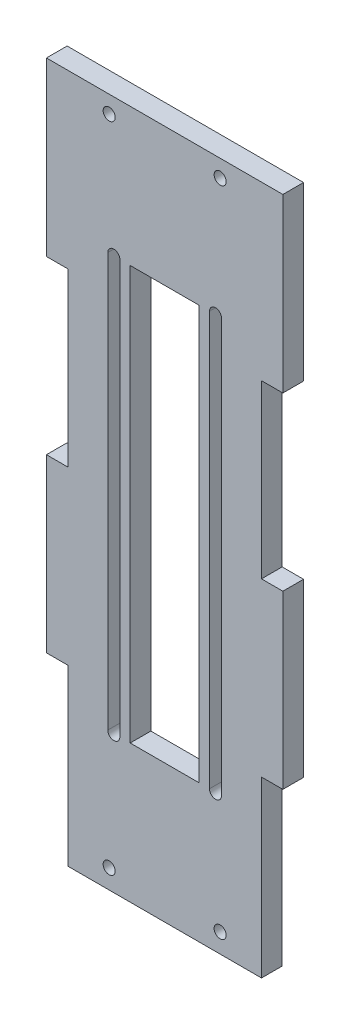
ISO-10303-21;
HEADER;
FILE_DESCRIPTION(('STEP AP214'),'2;1');
FILE_NAME('part.step','',(''),(''),'','','');
FILE_SCHEMA(('AUTOMOTIVE_DESIGN { 1 0 10303 214 1 1 1 1 }'));
ENDSEC;
DATA;
#1=APPLICATION_CONTEXT('core data for automotive mechanical design processes');
#2=APPLICATION_PROTOCOL_DEFINITION('international standard','automotive_design',2000,#1);
#3=PRODUCT_CONTEXT('',#1,'mechanical');
#4=PRODUCT('Part','Part','',(#3));
#5=PRODUCT_RELATED_PRODUCT_CATEGORY('part','',(#4));
#6=PRODUCT_DEFINITION_FORMATION('','',#4);
#7=PRODUCT_DEFINITION_CONTEXT('part definition',#1,'design');
#8=PRODUCT_DEFINITION('design','',#6,#7);
#9=PRODUCT_DEFINITION_SHAPE('','',#8);
#10=(LENGTH_UNIT() NAMED_UNIT(*) SI_UNIT(.MILLI.,.METRE.));
#11=(NAMED_UNIT(*) PLANE_ANGLE_UNIT() SI_UNIT($,.RADIAN.));
#12=(NAMED_UNIT(*) SI_UNIT($,.STERADIAN.) SOLID_ANGLE_UNIT());
#13=UNCERTAINTY_MEASURE_WITH_UNIT(LENGTH_MEASURE(1.E-05),#10,'distance_accuracy_value','');
#14=(GEOMETRIC_REPRESENTATION_CONTEXT(3) GLOBAL_UNCERTAINTY_ASSIGNED_CONTEXT((#13)) GLOBAL_UNIT_ASSIGNED_CONTEXT((#10,
#11,#12)) REPRESENTATION_CONTEXT('',''));
#15=CARTESIAN_POINT('',(0.,0.,0.));
#16=DIRECTION('',(0.,0.,1.));
#17=DIRECTION('',(1.,0.,0.));
#18=AXIS2_PLACEMENT_3D('',#15,#16,#17);
#19=CARTESIAN_POINT('',(0.,0.,6.));
#20=DIRECTION('',(0.,0.,1.));
#21=DIRECTION('',(1.,0.,0.));
#22=AXIS2_PLACEMENT_3D('',#19,#20,#21);
#23=PLANE('',#22);
#24=CARTESIAN_POINT('',(12.,5.60000000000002,6.));
#25=DIRECTION('',(0.,0.,1.));
#26=DIRECTION('',(-1.,0.,0.));
#27=AXIS2_PLACEMENT_3D('',#24,#25,#26);
#28=CIRCLE('',#27,1.75);
#29=CARTESIAN_POINT('',(10.25,5.60000000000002,6.));
#30=VERTEX_POINT('',#29);
#31=EDGE_CURVE('E333',#30,#30,#28,.T.);
#32=ORIENTED_EDGE('',*,*,#31,.F.);
#33=EDGE_LOOP('',(#32));
#34=FACE_BOUND('',#33,.T.);
#35=CARTESIAN_POINT('',(12.,195.,6.));
#36=DIRECTION('',(0.,0.,1.));
#37=DIRECTION('',(1.,0.,0.));
#38=AXIS2_PLACEMENT_3D('',#35,#36,#37);
#39=CIRCLE('',#38,1.75);
#40=CARTESIAN_POINT('',(13.75,195.,6.));
#41=VERTEX_POINT('',#40);
#42=EDGE_CURVE('E349',#41,#41,#39,.T.);
#43=ORIENTED_EDGE('',*,*,#42,.F.);
#44=EDGE_LOOP('',(#43));
#45=FACE_BOUND('',#44,.T.);
#46=DIRECTION('',(0.,-1.,0.));
#47=VECTOR('',#46,1.);
#48=CARTESIAN_POINT('',(0.,0.,6.));
#49=LINE('',#48,#47);
#50=CARTESIAN_POINT('',(0.,50.5,6.));
#51=VERTEX_POINT('',#50);
#52=CARTESIAN_POINT('',(0.,0.,6.));
#53=VERTEX_POINT('',#52);
#54=EDGE_CURVE('E400',#51,#53,#49,.T.);
#55=ORIENTED_EDGE('',*,*,#54,.T.);
#56=DIRECTION('',(1.,0.,0.));
#57=VECTOR('',#56,1.);
#58=CARTESIAN_POINT('',(0.,0.,6.));
#59=LINE('',#58,#57);
#60=CARTESIAN_POINT('',(56.2,0.,6.));
#61=VERTEX_POINT('',#60);
#62=EDGE_CURVE('E404',#53,#61,#59,.T.);
#63=ORIENTED_EDGE('',*,*,#62,.T.);
#64=DIRECTION('',(0.,1.,0.));
#65=VECTOR('',#64,1.);
#66=CARTESIAN_POINT('',(56.2,0.,6.));
#67=LINE('',#66,#65);
#68=CARTESIAN_POINT('',(56.2,50.5,6.));
#69=VERTEX_POINT('',#68);
#70=EDGE_CURVE('E408',#61,#69,#67,.T.);
#71=ORIENTED_EDGE('',*,*,#70,.T.);
#72=DIRECTION('',(1.,0.,0.));
#73=VECTOR('',#72,1.);
#74=CARTESIAN_POINT('',(56.2,50.5,6.));
#75=LINE('',#74,#73);
#76=CARTESIAN_POINT('',(62.4,50.5,6.));
#77=VERTEX_POINT('',#76);
#78=EDGE_CURVE('E411',#69,#77,#75,.T.);
#79=ORIENTED_EDGE('',*,*,#78,.T.);
#80=DIRECTION('',(0.,1.,0.));
#81=VECTOR('',#80,1.);
#82=CARTESIAN_POINT('',(62.4,50.5,6.));
#83=LINE('',#82,#81);
#84=CARTESIAN_POINT('',(62.4,100.3,6.));
#85=VERTEX_POINT('',#84);
#86=EDGE_CURVE('E414',#77,#85,#83,.T.);
#87=ORIENTED_EDGE('',*,*,#86,.T.);
#88=DIRECTION('',(-1.,0.,0.));
#89=VECTOR('',#88,1.);
#90=CARTESIAN_POINT('',(56.2,100.3,6.));
#91=LINE('',#90,#89);
#92=CARTESIAN_POINT('',(56.2,100.3,6.));
#93=VERTEX_POINT('',#92);
#94=EDGE_CURVE('E417',#85,#93,#91,.T.);
#95=ORIENTED_EDGE('',*,*,#94,.T.);
#96=DIRECTION('',(0.,1.,0.));
#97=VECTOR('',#96,1.);
#98=CARTESIAN_POINT('',(56.2,100.3,6.));
#99=LINE('',#98,#97);
#100=CARTESIAN_POINT('',(56.2,150.1,6.));
#101=VERTEX_POINT('',#100);
#102=EDGE_CURVE('E420',#93,#101,#99,.T.);
#103=ORIENTED_EDGE('',*,*,#102,.T.);
#104=DIRECTION('',(1.,0.,0.));
#105=VECTOR('',#104,1.);
#106=CARTESIAN_POINT('',(56.2,150.1,6.));
#107=LINE('',#106,#105);
#108=CARTESIAN_POINT('',(62.4,150.1,6.));
#109=VERTEX_POINT('',#108);
#110=EDGE_CURVE('E423',#101,#109,#107,.T.);
#111=ORIENTED_EDGE('',*,*,#110,.T.);
#112=DIRECTION('',(0.,1.,0.));
#113=VECTOR('',#112,1.);
#114=CARTESIAN_POINT('',(62.4,200.,6.));
#115=LINE('',#114,#113);
#116=CARTESIAN_POINT('',(62.4,200.,6.));
#117=VERTEX_POINT('',#116);
#118=EDGE_CURVE('E426',#109,#117,#115,.T.);
#119=ORIENTED_EDGE('',*,*,#118,.T.);
#120=DIRECTION('',(-1.,0.,0.));
#121=VECTOR('',#120,1.);
#122=CARTESIAN_POINT('',(56.2,200.,6.));
#123=LINE('',#122,#121);
#124=CARTESIAN_POINT('',(-6.2,200.,6.));
#125=VERTEX_POINT('',#124);
#126=EDGE_CURVE('E429',#117,#125,#123,.T.);
#127=ORIENTED_EDGE('',*,*,#126,.T.);
#128=DIRECTION('',(0.,-1.,0.));
#129=VECTOR('',#128,1.);
#130=CARTESIAN_POINT('',(-6.2,150.1,6.));
#131=LINE('',#130,#129);
#132=CARTESIAN_POINT('',(-6.2,150.1,6.));
#133=VERTEX_POINT('',#132);
#134=EDGE_CURVE('E432',#125,#133,#131,.T.);
#135=ORIENTED_EDGE('',*,*,#134,.T.);
#136=DIRECTION('',(1.,0.,0.));
#137=VECTOR('',#136,1.);
#138=CARTESIAN_POINT('',(0.,150.1,6.));
#139=LINE('',#138,#137);
#140=CARTESIAN_POINT('',(0.,150.1,6.));
#141=VERTEX_POINT('',#140);
#142=EDGE_CURVE('E435',#133,#141,#139,.T.);
#143=ORIENTED_EDGE('',*,*,#142,.T.);
#144=DIRECTION('',(0.,-1.,0.));
#145=VECTOR('',#144,1.);
#146=CARTESIAN_POINT('',(0.,100.3,6.));
#147=LINE('',#146,#145);
#148=CARTESIAN_POINT('',(0.,100.3,6.));
#149=VERTEX_POINT('',#148);
#150=EDGE_CURVE('E438',#141,#149,#147,.T.);
#151=ORIENTED_EDGE('',*,*,#150,.T.);
#152=DIRECTION('',(-1.,0.,0.));
#153=VECTOR('',#152,1.);
#154=CARTESIAN_POINT('',(0.,100.3,6.));
#155=LINE('',#154,#153);
#156=CARTESIAN_POINT('',(-6.2,100.3,6.));
#157=VERTEX_POINT('',#156);
#158=EDGE_CURVE('E441',#149,#157,#155,.T.);
#159=ORIENTED_EDGE('',*,*,#158,.T.);
#160=DIRECTION('',(0.,-1.,0.));
#161=VECTOR('',#160,1.);
#162=CARTESIAN_POINT('',(-6.2,50.5,6.));
#163=LINE('',#162,#161);
#164=CARTESIAN_POINT('',(-6.2,50.5,6.));
#165=VERTEX_POINT('',#164);
#166=EDGE_CURVE('E444',#157,#165,#163,.T.);
#167=ORIENTED_EDGE('',*,*,#166,.T.);
#168=DIRECTION('',(1.,0.,0.));
#169=VECTOR('',#168,1.);
#170=CARTESIAN_POINT('',(0.,50.5,6.));
#171=LINE('',#170,#169);
#172=EDGE_CURVE('E447',#165,#51,#171,.T.);
#173=ORIENTED_EDGE('',*,*,#172,.T.);
#174=EDGE_LOOP('',(#55,#63,#71,#79,#87,#95,#103,#111,#119,#127,#135,#143,#151,#159,#167,#173));
#175=FACE_BOUND('',#174,.T.);
#176=DIRECTION('',(0.,-1.,0.));
#177=VECTOR('',#176,1.);
#178=CARTESIAN_POINT('',(11.6,160.,6.));
#179=LINE('',#178,#177);
#180=CARTESIAN_POINT('',(11.6,160.,6.));
#181=VERTEX_POINT('',#180);
#182=CARTESIAN_POINT('',(11.6,40.,6.));
#183=VERTEX_POINT('',#182);
#184=EDGE_CURVE('E360',#181,#183,#179,.T.);
#185=ORIENTED_EDGE('',*,*,#184,.F.);
#186=CARTESIAN_POINT('',(13.35,160.,6.));
#187=DIRECTION('',(0.,0.,1.));
#188=DIRECTION('',(1.,0.,0.));
#189=AXIS2_PLACEMENT_3D('',#186,#187,#188);
#190=CIRCLE('',#189,1.75);
#191=CARTESIAN_POINT('',(15.1,160.,6.));
#192=VERTEX_POINT('',#191);
#193=EDGE_CURVE('E357',#192,#181,#190,.T.);
#194=ORIENTED_EDGE('',*,*,#193,.F.);
#195=DIRECTION('',(0.,1.,0.));
#196=VECTOR('',#195,1.);
#197=CARTESIAN_POINT('',(15.1,160.,6.));
#198=LINE('',#197,#196);
#199=CARTESIAN_POINT('',(15.1,40.,6.));
#200=VERTEX_POINT('',#199);
#201=EDGE_CURVE('E368',#200,#192,#198,.T.);
#202=ORIENTED_EDGE('',*,*,#201,.F.);
#203=CARTESIAN_POINT('',(13.35,40.,6.));
#204=DIRECTION('',(0.,0.,1.));
#205=DIRECTION('',(1.,0.,0.));
#206=AXIS2_PLACEMENT_3D('',#203,#204,#205);
#207=CIRCLE('',#206,1.75);
#208=EDGE_CURVE('E364',#183,#200,#207,.T.);
#209=ORIENTED_EDGE('',*,*,#208,.F.);
#210=EDGE_LOOP('',(#185,#194,#202,#209));
#211=FACE_BOUND('',#210,.T.);
#212=CARTESIAN_POINT('',(44.2,195.,6.));
#213=DIRECTION('',(0.,0.,1.));
#214=DIRECTION('',(-1.,0.,0.));
#215=AXIS2_PLACEMENT_3D('',#212,#213,#214);
#216=CIRCLE('',#215,1.75);
#217=CARTESIAN_POINT('',(42.45,195.,6.));
#218=VERTEX_POINT('',#217);
#219=EDGE_CURVE('E341',#218,#218,#216,.T.);
#220=ORIENTED_EDGE('',*,*,#219,.F.);
#221=EDGE_LOOP('',(#220));
#222=FACE_BOUND('',#221,.T.);
#223=CARTESIAN_POINT('',(44.2,5.60000000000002,6.));
#224=DIRECTION('',(0.,0.,1.));
#225=DIRECTION('',(1.,0.,0.));
#226=AXIS2_PLACEMENT_3D('',#223,#224,#225);
#227=CIRCLE('',#226,1.75);
#228=CARTESIAN_POINT('',(45.95,5.60000000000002,6.));
#229=VERTEX_POINT('',#228);
#230=EDGE_CURVE('E325',#229,#229,#227,.T.);
#231=ORIENTED_EDGE('',*,*,#230,.F.);
#232=EDGE_LOOP('',(#231));
#233=FACE_BOUND('',#232,.T.);
#234=DIRECTION('',(0.,1.,0.));
#235=VECTOR('',#234,1.);
#236=CARTESIAN_POINT('',(44.6,160.,6.));
#237=LINE('',#236,#235);
#238=CARTESIAN_POINT('',(44.6,40.,6.));
#239=VERTEX_POINT('',#238);
#240=CARTESIAN_POINT('',(44.6,160.,6.));
#241=VERTEX_POINT('',#240);
#242=EDGE_CURVE('E285',#239,#241,#237,.T.);
#243=ORIENTED_EDGE('',*,*,#242,.F.);
#244=CARTESIAN_POINT('',(42.85,40.,6.));
#245=DIRECTION('',(0.,0.,1.));
#246=DIRECTION('',(-1.,0.,0.));
#247=AXIS2_PLACEMENT_3D('',#244,#245,#246);
#248=CIRCLE('',#247,1.75);
#249=CARTESIAN_POINT('',(41.1,40.,6.));
#250=VERTEX_POINT('',#249);
#251=EDGE_CURVE('E282',#250,#239,#248,.T.);
#252=ORIENTED_EDGE('',*,*,#251,.F.);
#253=DIRECTION('',(0.,-1.,0.));
#254=VECTOR('',#253,1.);
#255=CARTESIAN_POINT('',(41.1,160.,6.));
#256=LINE('',#255,#254);
#257=CARTESIAN_POINT('',(41.1,160.,6.));
#258=VERTEX_POINT('',#257);
#259=EDGE_CURVE('E293',#258,#250,#256,.T.);
#260=ORIENTED_EDGE('',*,*,#259,.F.);
#261=CARTESIAN_POINT('',(42.85,160.,6.));
#262=DIRECTION('',(0.,0.,1.));
#263=DIRECTION('',(-1.,0.,0.));
#264=AXIS2_PLACEMENT_3D('',#261,#262,#263);
#265=CIRCLE('',#264,1.75);
#266=EDGE_CURVE('E289',#241,#258,#265,.T.);
#267=ORIENTED_EDGE('',*,*,#266,.F.);
#268=EDGE_LOOP('',(#243,#252,#260,#267));
#269=FACE_BOUND('',#268,.T.);
#270=DIRECTION('',(1.,0.,0.));
#271=VECTOR('',#270,1.);
#272=CARTESIAN_POINT('',(18.1,40.,6.));
#273=LINE('',#272,#271);
#274=CARTESIAN_POINT('',(18.1,40.,6.));
#275=VERTEX_POINT('',#274);
#276=CARTESIAN_POINT('',(38.1,40.,6.));
#277=VERTEX_POINT('',#276);
#278=EDGE_CURVE('E242',#275,#277,#273,.T.);
#279=ORIENTED_EDGE('',*,*,#278,.F.);
#280=DIRECTION('',(0.,-1.,0.));
#281=VECTOR('',#280,1.);
#282=CARTESIAN_POINT('',(18.0999999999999,160.,6.));
#283=LINE('',#282,#281);
#284=CARTESIAN_POINT('',(18.0999999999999,160.,6.));
#285=VERTEX_POINT('',#284);
#286=EDGE_CURVE('E233',#285,#275,#283,.T.);
#287=ORIENTED_EDGE('',*,*,#286,.F.);
#288=DIRECTION('',(-1.,0.,0.));
#289=VECTOR('',#288,1.);
#290=CARTESIAN_POINT('',(18.0999999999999,160.,6.));
#291=LINE('',#290,#289);
#292=CARTESIAN_POINT('',(38.0999999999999,160.,6.));
#293=VERTEX_POINT('',#292);
#294=EDGE_CURVE('E260',#293,#285,#291,.T.);
#295=ORIENTED_EDGE('',*,*,#294,.F.);
#296=DIRECTION('',(0.,1.,0.));
#297=VECTOR('',#296,1.);
#298=CARTESIAN_POINT('',(38.0999999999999,160.,6.));
#299=LINE('',#298,#297);
#300=EDGE_CURVE('E255',#277,#293,#299,.T.);
#301=ORIENTED_EDGE('',*,*,#300,.F.);
#302=EDGE_LOOP('',(#279,#287,#295,#301));
#303=FACE_BOUND('',#302,.T.);
#304=ADVANCED_FACE('F47',(#34,#45,#175,#211,#222,#233,#269,#303),#23,.T.);
#305=CARTESIAN_POINT('',(0.,0.,0.));
#306=DIRECTION('',(0.,0.,1.));
#307=DIRECTION('',(1.,0.,0.));
#308=AXIS2_PLACEMENT_3D('',#305,#306,#307);
#309=PLANE('',#308);
#310=CARTESIAN_POINT('',(42.85,40.,0.));
#311=DIRECTION('',(0.,0.,1.));
#312=DIRECTION('',(-1.,0.,0.));
#313=AXIS2_PLACEMENT_3D('',#310,#311,#312);
#314=CIRCLE('',#313,1.75);
#315=CARTESIAN_POINT('',(41.1,40.,0.));
#316=VERTEX_POINT('',#315);
#317=CARTESIAN_POINT('',(44.6,40.,0.));
#318=VERTEX_POINT('',#317);
#319=EDGE_CURVE('E251',#316,#318,#314,.T.);
#320=ORIENTED_EDGE('',*,*,#319,.T.);
#321=DIRECTION('',(0.,1.,0.));
#322=VECTOR('',#321,1.);
#323=CARTESIAN_POINT('',(44.6,160.,0.));
#324=LINE('',#323,#322);
#325=CARTESIAN_POINT('',(44.6,160.,0.));
#326=VERTEX_POINT('',#325);
#327=EDGE_CURVE('E300',#318,#326,#324,.T.);
#328=ORIENTED_EDGE('',*,*,#327,.T.);
#329=CARTESIAN_POINT('',(42.85,160.,0.));
#330=DIRECTION('',(0.,0.,1.));
#331=DIRECTION('',(-1.,0.,0.));
#332=AXIS2_PLACEMENT_3D('',#329,#330,#331);
#333=CIRCLE('',#332,1.75);
#334=CARTESIAN_POINT('',(41.1,160.,0.));
#335=VERTEX_POINT('',#334);
#336=EDGE_CURVE('E304',#326,#335,#333,.T.);
#337=ORIENTED_EDGE('',*,*,#336,.T.);
#338=DIRECTION('',(0.,-1.,0.));
#339=VECTOR('',#338,1.);
#340=CARTESIAN_POINT('',(41.1,160.,0.));
#341=LINE('',#340,#339);
#342=EDGE_CURVE('E286',#335,#316,#341,.T.);
#343=ORIENTED_EDGE('',*,*,#342,.T.);
#344=EDGE_LOOP('',(#320,#328,#337,#343));
#345=FACE_BOUND('',#344,.T.);
#346=DIRECTION('',(0.,-1.,0.));
#347=VECTOR('',#346,1.);
#348=CARTESIAN_POINT('',(0.,0.,0.));
#349=LINE('',#348,#347);
#350=CARTESIAN_POINT('',(0.,50.5,0.));
#351=VERTEX_POINT('',#350);
#352=CARTESIAN_POINT('',(0.,0.,0.));
#353=VERTEX_POINT('',#352);
#354=EDGE_CURVE('E399',#351,#353,#349,.T.);
#355=ORIENTED_EDGE('',*,*,#354,.F.);
#356=DIRECTION('',(1.,0.,0.));
#357=VECTOR('',#356,1.);
#358=CARTESIAN_POINT('',(0.,50.5,0.));
#359=LINE('',#358,#357);
#360=CARTESIAN_POINT('',(-6.2,50.5,0.));
#361=VERTEX_POINT('',#360);
#362=EDGE_CURVE('E405',#361,#351,#359,.T.);
#363=ORIENTED_EDGE('',*,*,#362,.F.);
#364=DIRECTION('',(0.,-1.,0.));
#365=VECTOR('',#364,1.);
#366=CARTESIAN_POINT('',(-6.2,50.5,0.));
#367=LINE('',#366,#365);
#368=CARTESIAN_POINT('',(-6.2,100.3,0.));
#369=VERTEX_POINT('',#368);
#370=EDGE_CURVE('E494',#369,#361,#367,.T.);
#371=ORIENTED_EDGE('',*,*,#370,.F.);
#372=DIRECTION('',(-1.,0.,0.));
#373=VECTOR('',#372,1.);
#374=CARTESIAN_POINT('',(0.,100.3,0.));
#375=LINE('',#374,#373);
#376=CARTESIAN_POINT('',(0.,100.3,0.));
#377=VERTEX_POINT('',#376);
#378=EDGE_CURVE('E491',#377,#369,#375,.T.);
#379=ORIENTED_EDGE('',*,*,#378,.F.);
#380=DIRECTION('',(0.,-1.,0.));
#381=VECTOR('',#380,1.);
#382=CARTESIAN_POINT('',(0.,100.3,0.));
#383=LINE('',#382,#381);
#384=CARTESIAN_POINT('',(0.,150.1,0.));
#385=VERTEX_POINT('',#384);
#386=EDGE_CURVE('E488',#385,#377,#383,.T.);
#387=ORIENTED_EDGE('',*,*,#386,.F.);
#388=DIRECTION('',(1.,0.,0.));
#389=VECTOR('',#388,1.);
#390=CARTESIAN_POINT('',(0.,150.1,0.));
#391=LINE('',#390,#389);
#392=CARTESIAN_POINT('',(-6.2,150.1,0.));
#393=VERTEX_POINT('',#392);
#394=EDGE_CURVE('E485',#393,#385,#391,.T.);
#395=ORIENTED_EDGE('',*,*,#394,.F.);
#396=DIRECTION('',(0.,-1.,0.));
#397=VECTOR('',#396,1.);
#398=CARTESIAN_POINT('',(-6.2,150.1,0.));
#399=LINE('',#398,#397);
#400=CARTESIAN_POINT('',(-6.2,200.,0.));
#401=VERTEX_POINT('',#400);
#402=EDGE_CURVE('E482',#401,#393,#399,.T.);
#403=ORIENTED_EDGE('',*,*,#402,.F.);
#404=DIRECTION('',(-1.,0.,0.));
#405=VECTOR('',#404,1.);
#406=CARTESIAN_POINT('',(0.,200.,0.));
#407=LINE('',#406,#405);
#408=CARTESIAN_POINT('',(62.4,200.,0.));
#409=VERTEX_POINT('',#408);
#410=EDGE_CURVE('E479',#409,#401,#407,.T.);
#411=ORIENTED_EDGE('',*,*,#410,.F.);
#412=DIRECTION('',(0.,1.,0.));
#413=VECTOR('',#412,1.);
#414=CARTESIAN_POINT('',(62.4,200.,0.));
#415=LINE('',#414,#413);
#416=CARTESIAN_POINT('',(62.4,150.1,0.));
#417=VERTEX_POINT('',#416);
#418=EDGE_CURVE('E475',#417,#409,#415,.T.);
#419=ORIENTED_EDGE('',*,*,#418,.F.);
#420=DIRECTION('',(1.,0.,0.));
#421=VECTOR('',#420,1.);
#422=CARTESIAN_POINT('',(56.2,150.1,0.));
#423=LINE('',#422,#421);
#424=CARTESIAN_POINT('',(56.2,150.1,0.));
#425=VERTEX_POINT('',#424);
#426=EDGE_CURVE('E472',#425,#417,#423,.T.);
#427=ORIENTED_EDGE('',*,*,#426,.F.);
#428=DIRECTION('',(0.,1.,0.));
#429=VECTOR('',#428,1.);
#430=CARTESIAN_POINT('',(56.2,100.3,0.));
#431=LINE('',#430,#429);
#432=CARTESIAN_POINT('',(56.2,100.3,0.));
#433=VERTEX_POINT('',#432);
#434=EDGE_CURVE('E469',#433,#425,#431,.T.);
#435=ORIENTED_EDGE('',*,*,#434,.F.);
#436=DIRECTION('',(-1.,0.,0.));
#437=VECTOR('',#436,1.);
#438=CARTESIAN_POINT('',(56.2,100.3,0.));
#439=LINE('',#438,#437);
#440=CARTESIAN_POINT('',(62.4,100.3,0.));
#441=VERTEX_POINT('',#440);
#442=EDGE_CURVE('E466',#441,#433,#439,.T.);
#443=ORIENTED_EDGE('',*,*,#442,.F.);
#444=DIRECTION('',(0.,1.,0.));
#445=VECTOR('',#444,1.);
#446=CARTESIAN_POINT('',(62.4,50.5,0.));
#447=LINE('',#446,#445);
#448=CARTESIAN_POINT('',(62.4,50.5,0.));
#449=VERTEX_POINT('',#448);
#450=EDGE_CURVE('E463',#449,#441,#447,.T.);
#451=ORIENTED_EDGE('',*,*,#450,.F.);
#452=DIRECTION('',(1.,0.,0.));
#453=VECTOR('',#452,1.);
#454=CARTESIAN_POINT('',(56.2,50.5,0.));
#455=LINE('',#454,#453);
#456=CARTESIAN_POINT('',(56.2,50.5,0.));
#457=VERTEX_POINT('',#456);
#458=EDGE_CURVE('E460',#457,#449,#455,.T.);
#459=ORIENTED_EDGE('',*,*,#458,.F.);
#460=DIRECTION('',(0.,1.,0.));
#461=VECTOR('',#460,1.);
#462=CARTESIAN_POINT('',(56.2,0.,0.));
#463=LINE('',#462,#461);
#464=CARTESIAN_POINT('',(56.2,0.,0.));
#465=VERTEX_POINT('',#464);
#466=EDGE_CURVE('E457',#465,#457,#463,.T.);
#467=ORIENTED_EDGE('',*,*,#466,.F.);
#468=DIRECTION('',(1.,0.,0.));
#469=VECTOR('',#468,1.);
#470=CARTESIAN_POINT('',(0.,0.,0.));
#471=LINE('',#470,#469);
#472=EDGE_CURVE('E454',#353,#465,#471,.T.);
#473=ORIENTED_EDGE('',*,*,#472,.F.);
#474=EDGE_LOOP('',(#355,#363,#371,#379,#387,#395,#403,#411,#419,#427,#435,#443,#451,#459,#467,#473));
#475=FACE_BOUND('',#474,.T.);
#476=CARTESIAN_POINT('',(13.35,160.,0.));
#477=DIRECTION('',(0.,0.,1.));
#478=DIRECTION('',(1.,0.,0.));
#479=AXIS2_PLACEMENT_3D('',#476,#477,#478);
#480=CIRCLE('',#479,1.75);
#481=CARTESIAN_POINT('',(15.1,160.,0.));
#482=VERTEX_POINT('',#481);
#483=CARTESIAN_POINT('',(11.6,160.,0.));
#484=VERTEX_POINT('',#483);
#485=EDGE_CURVE('E353',#482,#484,#480,.T.);
#486=ORIENTED_EDGE('',*,*,#485,.T.);
#487=DIRECTION('',(0.,-1.,0.));
#488=VECTOR('',#487,1.);
#489=CARTESIAN_POINT('',(11.6,160.,0.));
#490=LINE('',#489,#488);
#491=CARTESIAN_POINT('',(11.6,40.,0.));
#492=VERTEX_POINT('',#491);
#493=EDGE_CURVE('E375',#484,#492,#490,.T.);
#494=ORIENTED_EDGE('',*,*,#493,.T.);
#495=CARTESIAN_POINT('',(13.35,40.,0.));
#496=DIRECTION('',(0.,0.,1.));
#497=DIRECTION('',(1.,0.,0.));
#498=AXIS2_PLACEMENT_3D('',#495,#496,#497);
#499=CIRCLE('',#498,1.75);
#500=CARTESIAN_POINT('',(15.1,40.,0.));
#501=VERTEX_POINT('',#500);
#502=EDGE_CURVE('E379',#492,#501,#499,.T.);
#503=ORIENTED_EDGE('',*,*,#502,.T.);
#504=DIRECTION('',(0.,1.,0.));
#505=VECTOR('',#504,1.);
#506=CARTESIAN_POINT('',(15.1,160.,0.));
#507=LINE('',#506,#505);
#508=EDGE_CURVE('E361',#501,#482,#507,.T.);
#509=ORIENTED_EDGE('',*,*,#508,.T.);
#510=EDGE_LOOP('',(#486,#494,#503,#509));
#511=FACE_BOUND('',#510,.T.);
#512=CARTESIAN_POINT('',(12.,195.,0.));
#513=DIRECTION('',(0.,0.,1.));
#514=DIRECTION('',(1.,0.,0.));
#515=AXIS2_PLACEMENT_3D('',#512,#513,#514);
#516=CIRCLE('',#515,1.75);
#517=CARTESIAN_POINT('',(13.75,195.,0.));
#518=VERTEX_POINT('',#517);
#519=EDGE_CURVE('E345',#518,#518,#516,.T.);
#520=ORIENTED_EDGE('',*,*,#519,.T.);
#521=EDGE_LOOP('',(#520));
#522=FACE_BOUND('',#521,.T.);
#523=CARTESIAN_POINT('',(44.2,195.,0.));
#524=DIRECTION('',(0.,0.,1.));
#525=DIRECTION('',(-1.,0.,0.));
#526=AXIS2_PLACEMENT_3D('',#523,#524,#525);
#527=CIRCLE('',#526,1.75);
#528=CARTESIAN_POINT('',(42.45,195.,0.));
#529=VERTEX_POINT('',#528);
#530=EDGE_CURVE('E337',#529,#529,#527,.T.);
#531=ORIENTED_EDGE('',*,*,#530,.T.);
#532=EDGE_LOOP('',(#531));
#533=FACE_BOUND('',#532,.T.);
#534=CARTESIAN_POINT('',(12.,5.60000000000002,0.));
#535=DIRECTION('',(0.,0.,1.));
#536=DIRECTION('',(-1.,0.,0.));
#537=AXIS2_PLACEMENT_3D('',#534,#535,#536);
#538=CIRCLE('',#537,1.75);
#539=CARTESIAN_POINT('',(10.25,5.60000000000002,0.));
#540=VERTEX_POINT('',#539);
#541=EDGE_CURVE('E329',#540,#540,#538,.T.);
#542=ORIENTED_EDGE('',*,*,#541,.T.);
#543=EDGE_LOOP('',(#542));
#544=FACE_BOUND('',#543,.T.);
#545=CARTESIAN_POINT('',(44.2,5.60000000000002,0.));
#546=DIRECTION('',(0.,0.,1.));
#547=DIRECTION('',(1.,0.,0.));
#548=AXIS2_PLACEMENT_3D('',#545,#546,#547);
#549=CIRCLE('',#548,1.75);
#550=CARTESIAN_POINT('',(45.95,5.60000000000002,0.));
#551=VERTEX_POINT('',#550);
#552=EDGE_CURVE('E324',#551,#551,#549,.T.);
#553=ORIENTED_EDGE('',*,*,#552,.T.);
#554=EDGE_LOOP('',(#553));
#555=FACE_BOUND('',#554,.T.);
#556=DIRECTION('',(0.,-1.,0.));
#557=VECTOR('',#556,1.);
#558=CARTESIAN_POINT('',(18.0999999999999,160.,0.));
#559=LINE('',#558,#557);
#560=CARTESIAN_POINT('',(18.0999999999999,160.,0.));
#561=VERTEX_POINT('',#560);
#562=CARTESIAN_POINT('',(18.1,40.,0.));
#563=VERTEX_POINT('',#562);
#564=EDGE_CURVE('E71',#561,#563,#559,.T.);
#565=ORIENTED_EDGE('',*,*,#564,.T.);
#566=DIRECTION('',(1.,0.,0.));
#567=VECTOR('',#566,1.);
#568=CARTESIAN_POINT('',(18.1,40.,0.));
#569=LINE('',#568,#567);
#570=CARTESIAN_POINT('',(38.1,40.,0.));
#571=VERTEX_POINT('',#570);
#572=EDGE_CURVE('E249',#563,#571,#569,.T.);
#573=ORIENTED_EDGE('',*,*,#572,.T.);
#574=DIRECTION('',(0.,1.,0.));
#575=VECTOR('',#574,1.);
#576=CARTESIAN_POINT('',(38.0999999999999,160.,0.));
#577=LINE('',#576,#575);
#578=CARTESIAN_POINT('',(38.0999999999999,160.,0.));
#579=VERTEX_POINT('',#578);
#580=EDGE_CURVE('E269',#571,#579,#577,.T.);
#581=ORIENTED_EDGE('',*,*,#580,.T.);
#582=DIRECTION('',(-1.,0.,0.));
#583=VECTOR('',#582,1.);
#584=CARTESIAN_POINT('',(18.0999999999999,160.,0.));
#585=LINE('',#584,#583);
#586=EDGE_CURVE('E243',#579,#561,#585,.T.);
#587=ORIENTED_EDGE('',*,*,#586,.T.);
#588=EDGE_LOOP('',(#565,#573,#581,#587));
#589=FACE_BOUND('',#588,.T.);
#590=ADVANCED_FACE('F566',(#345,#475,#511,#522,#533,#544,#555,#589),#309,.F.);
#591=CARTESIAN_POINT('',(0.,0.,6.));
#592=DIRECTION('',(1.,0.,0.));
#593=DIRECTION('',(0.,0.,-1.));
#594=AXIS2_PLACEMENT_3D('',#591,#592,#593);
#595=PLANE('',#594);
#596=ORIENTED_EDGE('',*,*,#354,.T.);
#597=DIRECTION('',(0.,0.,-1.));
#598=VECTOR('',#597,1.);
#599=CARTESIAN_POINT('',(0.,0.,6.));
#600=LINE('',#599,#598);
#601=EDGE_CURVE('E11',#53,#353,#600,.T.);
#602=ORIENTED_EDGE('',*,*,#601,.F.);
#603=ORIENTED_EDGE('',*,*,#54,.F.);
#604=DIRECTION('',(0.,0.,-1.));
#605=VECTOR('',#604,1.);
#606=CARTESIAN_POINT('',(0.,50.5,6.));
#607=LINE('',#606,#605);
#608=EDGE_CURVE('E450',#51,#351,#607,.T.);
#609=ORIENTED_EDGE('',*,*,#608,.T.);
#610=EDGE_LOOP('',(#596,#602,#603,#609));
#611=FACE_BOUND('',#610,.T.);
#612=ADVANCED_FACE('F49',(#611),#595,.F.);
#613=CARTESIAN_POINT('',(0.,0.,6.));
#614=DIRECTION('',(0.,1.,0.));
#615=DIRECTION('',(0.,0.,1.));
#616=AXIS2_PLACEMENT_3D('',#613,#614,#615);
#617=PLANE('',#616);
#618=ORIENTED_EDGE('',*,*,#472,.T.);
#619=DIRECTION('',(0.,0.,-1.));
#620=VECTOR('',#619,1.);
#621=CARTESIAN_POINT('',(56.2,0.,6.));
#622=LINE('',#621,#620);
#623=EDGE_CURVE('E56',#61,#465,#622,.T.);
#624=ORIENTED_EDGE('',*,*,#623,.F.);
#625=ORIENTED_EDGE('',*,*,#62,.F.);
#626=ORIENTED_EDGE('',*,*,#601,.T.);
#627=EDGE_LOOP('',(#618,#624,#625,#626));
#628=FACE_BOUND('',#627,.T.);
#629=ADVANCED_FACE('F584',(#628),#617,.F.);
#630=CARTESIAN_POINT('',(56.2,0.,6.));
#631=DIRECTION('',(-1.,0.,0.));
#632=DIRECTION('',(0.,0.,1.));
#633=AXIS2_PLACEMENT_3D('',#630,#631,#632);
#634=PLANE('',#633);
#635=ORIENTED_EDGE('',*,*,#466,.T.);
#636=DIRECTION('',(0.,0.,-1.));
#637=VECTOR('',#636,1.);
#638=CARTESIAN_POINT('',(56.2,50.5,6.));
#639=LINE('',#638,#637);
#640=EDGE_CURVE('E550',#69,#457,#639,.T.);
#641=ORIENTED_EDGE('',*,*,#640,.F.);
#642=ORIENTED_EDGE('',*,*,#70,.F.);
#643=ORIENTED_EDGE('',*,*,#623,.T.);
#644=EDGE_LOOP('',(#635,#641,#642,#643));
#645=FACE_BOUND('',#644,.T.);
#646=ADVANCED_FACE('F560',(#645),#634,.F.);
#647=CARTESIAN_POINT('',(56.2,50.5,6.));
#648=DIRECTION('',(0.,1.,0.));
#649=DIRECTION('',(0.,0.,1.));
#650=AXIS2_PLACEMENT_3D('',#647,#648,#649);
#651=PLANE('',#650);
#652=ORIENTED_EDGE('',*,*,#458,.T.);
#653=DIRECTION('',(0.,0.,-1.));
#654=VECTOR('',#653,1.);
#655=CARTESIAN_POINT('',(62.4,50.5,6.));
#656=LINE('',#655,#654);
#657=EDGE_CURVE('E546',#77,#449,#656,.T.);
#658=ORIENTED_EDGE('',*,*,#657,.F.);
#659=ORIENTED_EDGE('',*,*,#78,.F.);
#660=ORIENTED_EDGE('',*,*,#640,.T.);
#661=EDGE_LOOP('',(#652,#658,#659,#660));
#662=FACE_BOUND('',#661,.T.);
#663=ADVANCED_FACE('F572',(#662),#651,.F.);
#664=CARTESIAN_POINT('',(62.4,50.5,6.));
#665=DIRECTION('',(-1.,0.,0.));
#666=DIRECTION('',(0.,0.,1.));
#667=AXIS2_PLACEMENT_3D('',#664,#665,#666);
#668=PLANE('',#667);
#669=ORIENTED_EDGE('',*,*,#450,.T.);
#670=DIRECTION('',(0.,0.,-1.));
#671=VECTOR('',#670,1.);
#672=CARTESIAN_POINT('',(62.4,100.3,6.));
#673=LINE('',#672,#671);
#674=EDGE_CURVE('E542',#85,#441,#673,.T.);
#675=ORIENTED_EDGE('',*,*,#674,.F.);
#676=ORIENTED_EDGE('',*,*,#86,.F.);
#677=ORIENTED_EDGE('',*,*,#657,.T.);
#678=EDGE_LOOP('',(#669,#675,#676,#677));
#679=FACE_BOUND('',#678,.T.);
#680=ADVANCED_FACE('F576',(#679),#668,.F.);
#681=CARTESIAN_POINT('',(56.2,100.3,6.));
#682=DIRECTION('',(0.,-1.,0.));
#683=DIRECTION('',(0.,0.,-1.));
#684=AXIS2_PLACEMENT_3D('',#681,#682,#683);
#685=PLANE('',#684);
#686=ORIENTED_EDGE('',*,*,#442,.T.);
#687=DIRECTION('',(0.,0.,-1.));
#688=VECTOR('',#687,1.);
#689=CARTESIAN_POINT('',(56.2,100.3,6.));
#690=LINE('',#689,#688);
#691=EDGE_CURVE('E538',#93,#433,#690,.T.);
#692=ORIENTED_EDGE('',*,*,#691,.F.);
#693=ORIENTED_EDGE('',*,*,#94,.F.);
#694=ORIENTED_EDGE('',*,*,#674,.T.);
#695=EDGE_LOOP('',(#686,#692,#693,#694));
#696=FACE_BOUND('',#695,.T.);
#697=ADVANCED_FACE('F636',(#696),#685,.F.);
#698=CARTESIAN_POINT('',(56.2,100.3,6.));
#699=DIRECTION('',(-1.,0.,0.));
#700=DIRECTION('',(0.,-1.,0.));
#701=AXIS2_PLACEMENT_3D('',#698,#699,#700);
#702=PLANE('',#701);
#703=ORIENTED_EDGE('',*,*,#434,.T.);
#704=DIRECTION('',(0.,0.,-1.));
#705=VECTOR('',#704,1.);
#706=CARTESIAN_POINT('',(56.2,150.1,6.));
#707=LINE('',#706,#705);
#708=EDGE_CURVE('E534',#101,#425,#707,.T.);
#709=ORIENTED_EDGE('',*,*,#708,.F.);
#710=ORIENTED_EDGE('',*,*,#102,.F.);
#711=ORIENTED_EDGE('',*,*,#691,.T.);
#712=EDGE_LOOP('',(#703,#709,#710,#711));
#713=FACE_BOUND('',#712,.T.);
#714=ADVANCED_FACE('F634',(#713),#702,.F.);
#715=CARTESIAN_POINT('',(56.2,150.1,6.));
#716=DIRECTION('',(0.,1.,0.));
#717=DIRECTION('',(0.,0.,1.));
#718=AXIS2_PLACEMENT_3D('',#715,#716,#717);
#719=PLANE('',#718);
#720=ORIENTED_EDGE('',*,*,#426,.T.);
#721=DIRECTION('',(0.,0.,-1.));
#722=VECTOR('',#721,1.);
#723=CARTESIAN_POINT('',(62.4,150.1,6.));
#724=LINE('',#723,#722);
#725=EDGE_CURVE('E530',#109,#417,#724,.T.);
#726=ORIENTED_EDGE('',*,*,#725,.F.);
#727=ORIENTED_EDGE('',*,*,#110,.F.);
#728=ORIENTED_EDGE('',*,*,#708,.T.);
#729=EDGE_LOOP('',(#720,#726,#727,#728));
#730=FACE_BOUND('',#729,.T.);
#731=ADVANCED_FACE('F631',(#730),#719,.F.);
#732=CARTESIAN_POINT('',(62.4,200.,6.));
#733=DIRECTION('',(-1.,0.,0.));
#734=DIRECTION('',(0.,-1.,0.));
#735=AXIS2_PLACEMENT_3D('',#732,#733,#734);
#736=PLANE('',#735);
#737=ORIENTED_EDGE('',*,*,#418,.T.);
#738=DIRECTION('',(0.,0.,-1.));
#739=VECTOR('',#738,1.);
#740=CARTESIAN_POINT('',(62.4,200.,6.));
#741=LINE('',#740,#739);
#742=EDGE_CURVE('E526',#117,#409,#741,.T.);
#743=ORIENTED_EDGE('',*,*,#742,.F.);
#744=ORIENTED_EDGE('',*,*,#118,.F.);
#745=ORIENTED_EDGE('',*,*,#725,.T.);
#746=EDGE_LOOP('',(#737,#743,#744,#745));
#747=FACE_BOUND('',#746,.T.);
#748=ADVANCED_FACE('F622',(#747),#736,.F.);
#749=CARTESIAN_POINT('',(0.,200.,6.));
#750=DIRECTION('',(0.,-1.,0.));
#751=DIRECTION('',(0.,0.,-1.));
#752=AXIS2_PLACEMENT_3D('',#749,#750,#751);
#753=PLANE('',#752);
#754=ORIENTED_EDGE('',*,*,#410,.T.);
#755=DIRECTION('',(0.,0.,-1.));
#756=VECTOR('',#755,1.);
#757=CARTESIAN_POINT('',(-6.2,200.,6.));
#758=LINE('',#757,#756);
#759=EDGE_CURVE('E522',#125,#401,#758,.T.);
#760=ORIENTED_EDGE('',*,*,#759,.F.);
#761=ORIENTED_EDGE('',*,*,#126,.F.);
#762=ORIENTED_EDGE('',*,*,#742,.T.);
#763=EDGE_LOOP('',(#754,#760,#761,#762));
#764=FACE_BOUND('',#763,.T.);
#765=ADVANCED_FACE('F626',(#764),#753,.F.);
#766=CARTESIAN_POINT('',(-6.2,150.1,6.));
#767=DIRECTION('',(1.,0.,0.));
#768=DIRECTION('',(0.,1.,0.));
#769=AXIS2_PLACEMENT_3D('',#766,#767,#768);
#770=PLANE('',#769);
#771=ORIENTED_EDGE('',*,*,#402,.T.);
#772=DIRECTION('',(0.,0.,-1.));
#773=VECTOR('',#772,1.);
#774=CARTESIAN_POINT('',(-6.2,150.1,6.));
#775=LINE('',#774,#773);
#776=EDGE_CURVE('E518',#133,#393,#775,.T.);
#777=ORIENTED_EDGE('',*,*,#776,.F.);
#778=ORIENTED_EDGE('',*,*,#134,.F.);
#779=ORIENTED_EDGE('',*,*,#759,.T.);
#780=EDGE_LOOP('',(#771,#777,#778,#779));
#781=FACE_BOUND('',#780,.T.);
#782=ADVANCED_FACE('F615',(#781),#770,.F.);
#783=CARTESIAN_POINT('',(0.,150.1,6.));
#784=DIRECTION('',(0.,1.,0.));
#785=DIRECTION('',(0.,0.,1.));
#786=AXIS2_PLACEMENT_3D('',#783,#784,#785);
#787=PLANE('',#786);
#788=ORIENTED_EDGE('',*,*,#394,.T.);
#789=DIRECTION('',(0.,0.,-1.));
#790=VECTOR('',#789,1.);
#791=CARTESIAN_POINT('',(0.,150.1,6.));
#792=LINE('',#791,#790);
#793=EDGE_CURVE('E514',#141,#385,#792,.T.);
#794=ORIENTED_EDGE('',*,*,#793,.F.);
#795=ORIENTED_EDGE('',*,*,#142,.F.);
#796=ORIENTED_EDGE('',*,*,#776,.T.);
#797=EDGE_LOOP('',(#788,#794,#795,#796));
#798=FACE_BOUND('',#797,.T.);
#799=ADVANCED_FACE('F611',(#798),#787,.F.);
#800=CARTESIAN_POINT('',(0.,100.3,6.));
#801=DIRECTION('',(1.,0.,0.));
#802=DIRECTION('',(0.,1.,0.));
#803=AXIS2_PLACEMENT_3D('',#800,#801,#802);
#804=PLANE('',#803);
#805=ORIENTED_EDGE('',*,*,#386,.T.);
#806=DIRECTION('',(0.,0.,-1.));
#807=VECTOR('',#806,1.);
#808=CARTESIAN_POINT('',(0.,100.3,6.));
#809=LINE('',#808,#807);
#810=EDGE_CURVE('E510',#149,#377,#809,.T.);
#811=ORIENTED_EDGE('',*,*,#810,.F.);
#812=ORIENTED_EDGE('',*,*,#150,.F.);
#813=ORIENTED_EDGE('',*,*,#793,.T.);
#814=EDGE_LOOP('',(#805,#811,#812,#813));
#815=FACE_BOUND('',#814,.T.);
#816=ADVANCED_FACE('F606',(#815),#804,.F.);
#817=CARTESIAN_POINT('',(0.,100.3,6.));
#818=DIRECTION('',(0.,-1.,0.));
#819=DIRECTION('',(0.,0.,-1.));
#820=AXIS2_PLACEMENT_3D('',#817,#818,#819);
#821=PLANE('',#820);
#822=ORIENTED_EDGE('',*,*,#378,.T.);
#823=DIRECTION('',(0.,0.,-1.));
#824=VECTOR('',#823,1.);
#825=CARTESIAN_POINT('',(-6.2,100.3,6.));
#826=LINE('',#825,#824);
#827=EDGE_CURVE('E506',#157,#369,#826,.T.);
#828=ORIENTED_EDGE('',*,*,#827,.F.);
#829=ORIENTED_EDGE('',*,*,#158,.F.);
#830=ORIENTED_EDGE('',*,*,#810,.T.);
#831=EDGE_LOOP('',(#822,#828,#829,#830));
#832=FACE_BOUND('',#831,.T.);
#833=ADVANCED_FACE('F600',(#832),#821,.F.);
#834=CARTESIAN_POINT('',(-6.2,50.5,6.));
#835=DIRECTION('',(1.,0.,0.));
#836=DIRECTION('',(0.,0.,-1.));
#837=AXIS2_PLACEMENT_3D('',#834,#835,#836);
#838=PLANE('',#837);
#839=ORIENTED_EDGE('',*,*,#370,.T.);
#840=DIRECTION('',(0.,0.,-1.));
#841=VECTOR('',#840,1.);
#842=CARTESIAN_POINT('',(-6.2,50.5,6.));
#843=LINE('',#842,#841);
#844=EDGE_CURVE('E502',#165,#361,#843,.T.);
#845=ORIENTED_EDGE('',*,*,#844,.F.);
#846=ORIENTED_EDGE('',*,*,#166,.F.);
#847=ORIENTED_EDGE('',*,*,#827,.T.);
#848=EDGE_LOOP('',(#839,#845,#846,#847));
#849=FACE_BOUND('',#848,.T.);
#850=ADVANCED_FACE('F596',(#849),#838,.F.);
#851=CARTESIAN_POINT('',(0.,50.5,6.));
#852=DIRECTION('',(0.,1.,0.));
#853=DIRECTION('',(0.,0.,1.));
#854=AXIS2_PLACEMENT_3D('',#851,#852,#853);
#855=PLANE('',#854);
#856=ORIENTED_EDGE('',*,*,#362,.T.);
#857=ORIENTED_EDGE('',*,*,#608,.F.);
#858=ORIENTED_EDGE('',*,*,#172,.F.);
#859=ORIENTED_EDGE('',*,*,#844,.T.);
#860=EDGE_LOOP('',(#856,#857,#858,#859));
#861=FACE_BOUND('',#860,.T.);
#862=ADVANCED_FACE('F591',(#861),#855,.F.);
#863=CARTESIAN_POINT('',(13.35,160.,6.));
#864=DIRECTION('',(0.,0.,-1.));
#865=DIRECTION('',(-1.,0.,0.));
#866=AXIS2_PLACEMENT_3D('',#863,#864,#865);
#867=CYLINDRICAL_SURFACE('',#866,1.75);
#868=ORIENTED_EDGE('',*,*,#485,.F.);
#869=DIRECTION('',(0.,0.,-1.));
#870=VECTOR('',#869,1.);
#871=CARTESIAN_POINT('',(15.1,160.,6.));
#872=LINE('',#871,#870);
#873=EDGE_CURVE('E371',#192,#482,#872,.T.);
#874=ORIENTED_EDGE('',*,*,#873,.F.);
#875=ORIENTED_EDGE('',*,*,#193,.T.);
#876=DIRECTION('',(0.,0.,-1.));
#877=VECTOR('',#876,1.);
#878=CARTESIAN_POINT('',(11.6,160.,6.));
#879=LINE('',#878,#877);
#880=EDGE_CURVE('E395',#181,#484,#879,.T.);
#881=ORIENTED_EDGE('',*,*,#880,.T.);
#882=EDGE_LOOP('',(#868,#874,#875,#881));
#883=FACE_BOUND('',#882,.T.);
#884=ADVANCED_FACE('F656',(#883),#867,.F.);
#885=CARTESIAN_POINT('',(11.6,160.,6.));
#886=DIRECTION('',(1.,0.,0.));
#887=DIRECTION('',(0.,1.,0.));
#888=AXIS2_PLACEMENT_3D('',#885,#886,#887);
#889=PLANE('',#888);
#890=ORIENTED_EDGE('',*,*,#493,.F.);
#891=ORIENTED_EDGE('',*,*,#880,.F.);
#892=ORIENTED_EDGE('',*,*,#184,.T.);
#893=DIRECTION('',(0.,0.,-1.));
#894=VECTOR('',#893,1.);
#895=CARTESIAN_POINT('',(11.6,40.,6.));
#896=LINE('',#895,#894);
#897=EDGE_CURVE('E392',#183,#492,#896,.T.);
#898=ORIENTED_EDGE('',*,*,#897,.T.);
#899=EDGE_LOOP('',(#890,#891,#892,#898));
#900=FACE_BOUND('',#899,.T.);
#901=ADVANCED_FACE('F728',(#900),#889,.T.);
#902=CARTESIAN_POINT('',(13.35,40.,6.));
#903=DIRECTION('',(0.,0.,-1.));
#904=DIRECTION('',(-1.,0.,0.));
#905=AXIS2_PLACEMENT_3D('',#902,#903,#904);
#906=CYLINDRICAL_SURFACE('',#905,1.75);
#907=ORIENTED_EDGE('',*,*,#502,.F.);
#908=ORIENTED_EDGE('',*,*,#897,.F.);
#909=ORIENTED_EDGE('',*,*,#208,.T.);
#910=DIRECTION('',(0.,0.,-1.));
#911=VECTOR('',#910,1.);
#912=CARTESIAN_POINT('',(15.1,40.,6.));
#913=LINE('',#912,#911);
#914=EDGE_CURVE('E389',#200,#501,#913,.T.);
#915=ORIENTED_EDGE('',*,*,#914,.T.);
#916=EDGE_LOOP('',(#907,#908,#909,#915));
#917=FACE_BOUND('',#916,.T.);
#918=ADVANCED_FACE('F736',(#917),#906,.F.);
#919=CARTESIAN_POINT('',(15.1,160.,6.));
#920=DIRECTION('',(-1.,0.,0.));
#921=DIRECTION('',(0.,-1.,0.));
#922=AXIS2_PLACEMENT_3D('',#919,#920,#921);
#923=PLANE('',#922);
#924=ORIENTED_EDGE('',*,*,#508,.F.);
#925=ORIENTED_EDGE('',*,*,#914,.F.);
#926=ORIENTED_EDGE('',*,*,#201,.T.);
#927=ORIENTED_EDGE('',*,*,#873,.T.);
#928=EDGE_LOOP('',(#924,#925,#926,#927));
#929=FACE_BOUND('',#928,.T.);
#930=ADVANCED_FACE('F744',(#929),#923,.T.);
#931=CARTESIAN_POINT('',(12.,195.,6.));
#932=DIRECTION('',(0.,0.,-1.));
#933=DIRECTION('',(-1.,0.,0.));
#934=AXIS2_PLACEMENT_3D('',#931,#932,#933);
#935=CYLINDRICAL_SURFACE('',#934,1.75);
#936=ORIENTED_EDGE('',*,*,#42,.T.);
#937=EDGE_LOOP('',(#936));
#938=FACE_BOUND('',#937,.T.);
#939=ORIENTED_EDGE('',*,*,#519,.F.);
#940=EDGE_LOOP('',(#939));
#941=FACE_BOUND('',#940,.T.);
#942=ADVANCED_FACE('F753',(#938,#941),#935,.F.);
#943=CARTESIAN_POINT('',(44.2,195.,6.));
#944=DIRECTION('',(0.,0.,-1.));
#945=DIRECTION('',(-1.,0.,0.));
#946=AXIS2_PLACEMENT_3D('',#943,#944,#945);
#947=CYLINDRICAL_SURFACE('',#946,1.75);
#948=ORIENTED_EDGE('',*,*,#219,.T.);
#949=EDGE_LOOP('',(#948));
#950=FACE_BOUND('',#949,.T.);
#951=ORIENTED_EDGE('',*,*,#530,.F.);
#952=EDGE_LOOP('',(#951));
#953=FACE_BOUND('',#952,.T.);
#954=ADVANCED_FACE('F762',(#950,#953),#947,.F.);
#955=CARTESIAN_POINT('',(12.,5.60000000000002,6.));
#956=DIRECTION('',(0.,0.,-1.));
#957=DIRECTION('',(-1.,0.,0.));
#958=AXIS2_PLACEMENT_3D('',#955,#956,#957);
#959=CYLINDRICAL_SURFACE('',#958,1.75);
#960=ORIENTED_EDGE('',*,*,#31,.T.);
#961=EDGE_LOOP('',(#960));
#962=FACE_BOUND('',#961,.T.);
#963=ORIENTED_EDGE('',*,*,#541,.F.);
#964=EDGE_LOOP('',(#963));
#965=FACE_BOUND('',#964,.T.);
#966=ADVANCED_FACE('F771',(#962,#965),#959,.F.);
#967=CARTESIAN_POINT('',(44.2,5.60000000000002,6.));
#968=DIRECTION('',(0.,0.,-1.));
#969=DIRECTION('',(-1.,0.,0.));
#970=AXIS2_PLACEMENT_3D('',#967,#968,#969);
#971=CYLINDRICAL_SURFACE('',#970,1.75);
#972=ORIENTED_EDGE('',*,*,#230,.T.);
#973=EDGE_LOOP('',(#972));
#974=FACE_BOUND('',#973,.T.);
#975=ORIENTED_EDGE('',*,*,#552,.F.);
#976=EDGE_LOOP('',(#975));
#977=FACE_BOUND('',#976,.T.);
#978=ADVANCED_FACE('F780',(#974,#977),#971,.F.);
#979=CARTESIAN_POINT('',(42.85,40.,6.));
#980=DIRECTION('',(0.,0.,-1.));
#981=DIRECTION('',(-1.,0.,0.));
#982=AXIS2_PLACEMENT_3D('',#979,#980,#981);
#983=CYLINDRICAL_SURFACE('',#982,1.75);
#984=ORIENTED_EDGE('',*,*,#319,.F.);
#985=DIRECTION('',(0.,0.,-1.));
#986=VECTOR('',#985,1.);
#987=CARTESIAN_POINT('',(41.1,40.,6.));
#988=LINE('',#987,#986);
#989=EDGE_CURVE('E296',#250,#316,#988,.T.);
#990=ORIENTED_EDGE('',*,*,#989,.F.);
#991=ORIENTED_EDGE('',*,*,#251,.T.);
#992=DIRECTION('',(0.,0.,-1.));
#993=VECTOR('',#992,1.);
#994=CARTESIAN_POINT('',(44.6,40.,6.));
#995=LINE('',#994,#993);
#996=EDGE_CURVE('E320',#239,#318,#995,.T.);
#997=ORIENTED_EDGE('',*,*,#996,.T.);
#998=EDGE_LOOP('',(#984,#990,#991,#997));
#999=FACE_BOUND('',#998,.T.);
#1000=ADVANCED_FACE('F789',(#999),#983,.F.);
#1001=CARTESIAN_POINT('',(44.6,160.,6.));
#1002=DIRECTION('',(-1.,0.,0.));
#1003=DIRECTION('',(0.,-1.,0.));
#1004=AXIS2_PLACEMENT_3D('',#1001,#1002,#1003);
#1005=PLANE('',#1004);
#1006=ORIENTED_EDGE('',*,*,#327,.F.);
#1007=ORIENTED_EDGE('',*,*,#996,.F.);
#1008=ORIENTED_EDGE('',*,*,#242,.T.);
#1009=DIRECTION('',(0.,0.,-1.));
#1010=VECTOR('',#1009,1.);
#1011=CARTESIAN_POINT('',(44.6,160.,6.));
#1012=LINE('',#1011,#1010);
#1013=EDGE_CURVE('E317',#241,#326,#1012,.T.);
#1014=ORIENTED_EDGE('',*,*,#1013,.T.);
#1015=EDGE_LOOP('',(#1006,#1007,#1008,#1014));
#1016=FACE_BOUND('',#1015,.T.);
#1017=ADVANCED_FACE('F798',(#1016),#1005,.T.);
#1018=CARTESIAN_POINT('',(42.85,160.,6.));
#1019=DIRECTION('',(0.,0.,-1.));
#1020=DIRECTION('',(-1.,0.,0.));
#1021=AXIS2_PLACEMENT_3D('',#1018,#1019,#1020);
#1022=CYLINDRICAL_SURFACE('',#1021,1.75);
#1023=ORIENTED_EDGE('',*,*,#336,.F.);
#1024=ORIENTED_EDGE('',*,*,#1013,.F.);
#1025=ORIENTED_EDGE('',*,*,#266,.T.);
#1026=DIRECTION('',(0.,0.,-1.));
#1027=VECTOR('',#1026,1.);
#1028=CARTESIAN_POINT('',(41.1,160.,6.));
#1029=LINE('',#1028,#1027);
#1030=EDGE_CURVE('E314',#258,#335,#1029,.T.);
#1031=ORIENTED_EDGE('',*,*,#1030,.T.);
#1032=EDGE_LOOP('',(#1023,#1024,#1025,#1031));
#1033=FACE_BOUND('',#1032,.T.);
#1034=ADVANCED_FACE('F807',(#1033),#1022,.F.);
#1035=CARTESIAN_POINT('',(41.1,160.,6.));
#1036=DIRECTION('',(1.,0.,0.));
#1037=DIRECTION('',(0.,1.,0.));
#1038=AXIS2_PLACEMENT_3D('',#1035,#1036,#1037);
#1039=PLANE('',#1038);
#1040=ORIENTED_EDGE('',*,*,#342,.F.);
#1041=ORIENTED_EDGE('',*,*,#1030,.F.);
#1042=ORIENTED_EDGE('',*,*,#259,.T.);
#1043=ORIENTED_EDGE('',*,*,#989,.T.);
#1044=EDGE_LOOP('',(#1040,#1041,#1042,#1043));
#1045=FACE_BOUND('',#1044,.T.);
#1046=ADVANCED_FACE('F816',(#1045),#1039,.T.);
#1047=CARTESIAN_POINT('',(18.0999999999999,160.,6.));
#1048=DIRECTION('',(1.,0.,0.));
#1049=DIRECTION('',(0.,1.,0.));
#1050=AXIS2_PLACEMENT_3D('',#1047,#1048,#1049);
#1051=PLANE('',#1050);
#1052=ORIENTED_EDGE('',*,*,#564,.F.);
#1053=DIRECTION('',(0.,0.,-1.));
#1054=VECTOR('',#1053,1.);
#1055=CARTESIAN_POINT('',(18.0999999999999,160.,6.));
#1056=LINE('',#1055,#1054);
#1057=EDGE_CURVE('E237',#285,#561,#1056,.T.);
#1058=ORIENTED_EDGE('',*,*,#1057,.F.);
#1059=ORIENTED_EDGE('',*,*,#286,.T.);
#1060=DIRECTION('',(0.,0.,-1.));
#1061=VECTOR('',#1060,1.);
#1062=CARTESIAN_POINT('',(18.1,40.,6.));
#1063=LINE('',#1062,#1061);
#1064=EDGE_CURVE('E236',#275,#563,#1063,.T.);
#1065=ORIENTED_EDGE('',*,*,#1064,.T.);
#1066=EDGE_LOOP('',(#1052,#1058,#1059,#1065));
#1067=FACE_BOUND('',#1066,.T.);
#1068=ADVANCED_FACE('F235',(#1067),#1051,.T.);
#1069=CARTESIAN_POINT('',(18.1,40.,6.));
#1070=DIRECTION('',(0.,1.,0.));
#1071=DIRECTION('',(-1.,0.,0.));
#1072=AXIS2_PLACEMENT_3D('',#1069,#1070,#1071);
#1073=PLANE('',#1072);
#1074=ORIENTED_EDGE('',*,*,#572,.F.);
#1075=ORIENTED_EDGE('',*,*,#1064,.F.);
#1076=ORIENTED_EDGE('',*,*,#278,.T.);
#1077=DIRECTION('',(0.,0.,-1.));
#1078=VECTOR('',#1077,1.);
#1079=CARTESIAN_POINT('',(38.1,40.,6.));
#1080=LINE('',#1079,#1078);
#1081=EDGE_CURVE('E252',#277,#571,#1080,.T.);
#1082=ORIENTED_EDGE('',*,*,#1081,.T.);
#1083=EDGE_LOOP('',(#1074,#1075,#1076,#1082));
#1084=FACE_BOUND('',#1083,.T.);
#1085=ADVANCED_FACE('F246',(#1084),#1073,.T.);
#1086=CARTESIAN_POINT('',(38.0999999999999,160.,6.));
#1087=DIRECTION('',(-1.,0.,0.));
#1088=DIRECTION('',(0.,-1.,0.));
#1089=AXIS2_PLACEMENT_3D('',#1086,#1087,#1088);
#1090=PLANE('',#1089);
#1091=ORIENTED_EDGE('',*,*,#580,.F.);
#1092=ORIENTED_EDGE('',*,*,#1081,.F.);
#1093=ORIENTED_EDGE('',*,*,#300,.T.);
#1094=DIRECTION('',(0.,0.,-1.));
#1095=VECTOR('',#1094,1.);
#1096=CARTESIAN_POINT('',(38.0999999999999,160.,6.));
#1097=LINE('',#1096,#1095);
#1098=EDGE_CURVE('E63',#293,#579,#1097,.T.);
#1099=ORIENTED_EDGE('',*,*,#1098,.T.);
#1100=EDGE_LOOP('',(#1091,#1092,#1093,#1099));
#1101=FACE_BOUND('',#1100,.T.);
#1102=ADVANCED_FACE('F840',(#1101),#1090,.T.);
#1103=CARTESIAN_POINT('',(18.0999999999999,160.,6.));
#1104=DIRECTION('',(0.,-1.,0.));
#1105=DIRECTION('',(0.,0.,-1.));
#1106=AXIS2_PLACEMENT_3D('',#1103,#1104,#1105);
#1107=PLANE('',#1106);
#1108=ORIENTED_EDGE('',*,*,#586,.F.);
#1109=ORIENTED_EDGE('',*,*,#1098,.F.);
#1110=ORIENTED_EDGE('',*,*,#294,.T.);
#1111=ORIENTED_EDGE('',*,*,#1057,.T.);
#1112=EDGE_LOOP('',(#1108,#1109,#1110,#1111));
#1113=FACE_BOUND('',#1112,.T.);
#1114=ADVANCED_FACE('F848',(#1113),#1107,.T.);
#1115=CLOSED_SHELL('',(#304,#590,#612,#629,#646,#663,#680,#697,#714,#731,#748,#765,#782,#799,
#816,#833,#850,#862,#884,#901,#918,#930,#942,#954,#966,#978,#1000,#1017,#1034,#1046,#1068,#1085,
#1102,#1114));
#1116=MANIFOLD_SOLID_BREP('B2',#1115);
#1117=ADVANCED_BREP_SHAPE_REPRESENTATION('',(#18,#1116),#14);
#1118=SHAPE_DEFINITION_REPRESENTATION(#9,#1117);
ENDSEC;
END-ISO-10303-21;
